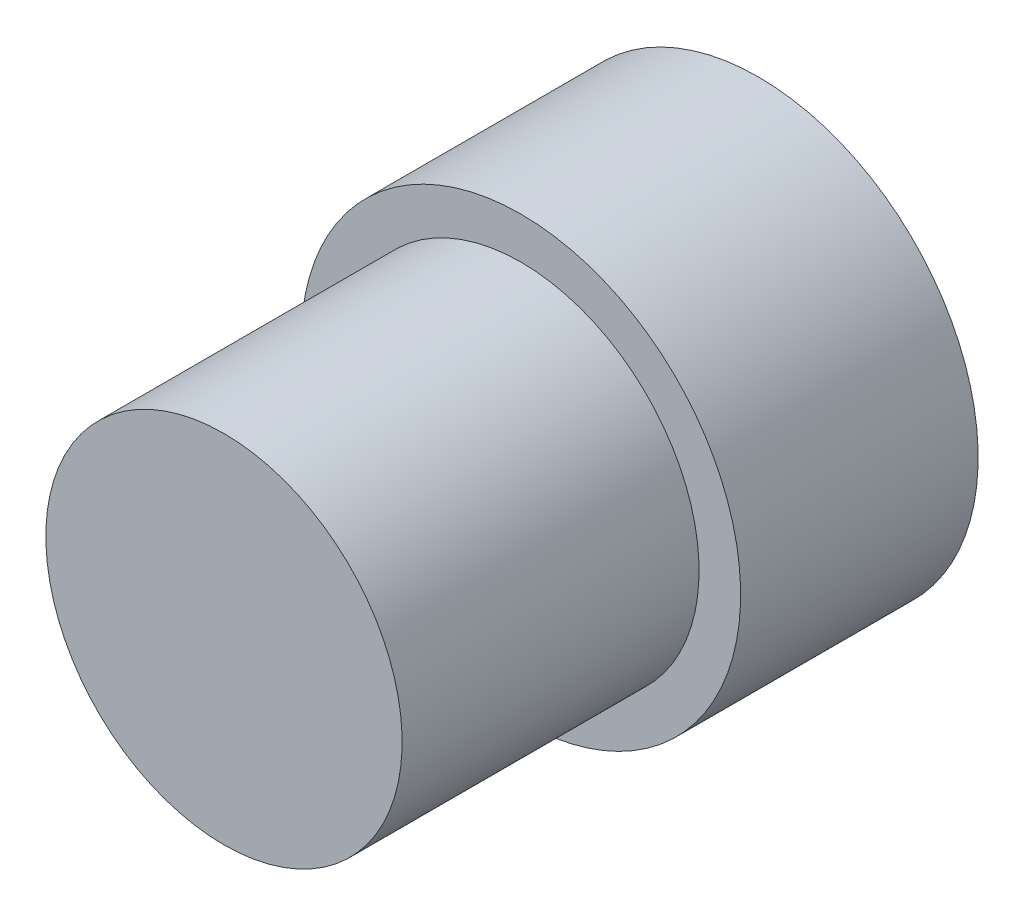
ISO-10303-21;
HEADER;
FILE_DESCRIPTION(('STEP AP214'),'2;1');
FILE_NAME('part.step','',(''),(''),'','','');
FILE_SCHEMA(('AUTOMOTIVE_DESIGN { 1 0 10303 214 1 1 1 1 }'));
ENDSEC;
DATA;
#1=APPLICATION_CONTEXT('core data for automotive mechanical design processes');
#2=APPLICATION_PROTOCOL_DEFINITION('international standard','automotive_design',2000,#1);
#3=PRODUCT_CONTEXT('',#1,'mechanical');
#4=PRODUCT('Part','Part','',(#3));
#5=PRODUCT_RELATED_PRODUCT_CATEGORY('part','',(#4));
#6=PRODUCT_DEFINITION_FORMATION('','',#4);
#7=PRODUCT_DEFINITION_CONTEXT('part definition',#1,'design');
#8=PRODUCT_DEFINITION('design','',#6,#7);
#9=PRODUCT_DEFINITION_SHAPE('','',#8);
#10=(LENGTH_UNIT() NAMED_UNIT(*) SI_UNIT(.MILLI.,.METRE.));
#11=(NAMED_UNIT(*) PLANE_ANGLE_UNIT() SI_UNIT($,.RADIAN.));
#12=(NAMED_UNIT(*) SI_UNIT($,.STERADIAN.) SOLID_ANGLE_UNIT());
#13=UNCERTAINTY_MEASURE_WITH_UNIT(LENGTH_MEASURE(1.E-05),#10,'distance_accuracy_value','');
#14=(GEOMETRIC_REPRESENTATION_CONTEXT(3) GLOBAL_UNCERTAINTY_ASSIGNED_CONTEXT((#13)) GLOBAL_UNIT_ASSIGNED_CONTEXT((#10,
#11,#12)) REPRESENTATION_CONTEXT('',''));
#15=CARTESIAN_POINT('',(0.,0.,0.));
#16=DIRECTION('',(0.,0.,1.));
#17=DIRECTION('',(1.,0.,0.));
#18=AXIS2_PLACEMENT_3D('',#15,#16,#17);
#19=CARTESIAN_POINT('',(0.,0.,0.));
#20=DIRECTION('',(0.,0.,-1.));
#21=DIRECTION('',(0.,-1.,0.));
#22=AXIS2_PLACEMENT_3D('',#19,#20,#21);
#23=CYLINDRICAL_SURFACE('',#22,8.);
#24=CARTESIAN_POINT('',(0.,0.,0.));
#25=DIRECTION('',(0.,0.,1.));
#26=DIRECTION('',(0.,-1.,0.));
#27=AXIS2_PLACEMENT_3D('',#24,#25,#26);
#28=CIRCLE('',#27,8.);
#29=CARTESIAN_POINT('',(0.,-8.,0.));
#30=VERTEX_POINT('',#29);
#31=EDGE_CURVE('E32',#30,#30,#28,.T.);
#32=ORIENTED_EDGE('',*,*,#31,.F.);
#33=EDGE_LOOP('',(#32));
#34=FACE_BOUND('',#33,.T.);
#35=CARTESIAN_POINT('',(0.,0.,20.));
#36=DIRECTION('',(0.,0.,1.));
#37=DIRECTION('',(0.,-1.,0.));
#38=AXIS2_PLACEMENT_3D('',#35,#36,#37);
#39=CIRCLE('',#38,8.);
#40=CARTESIAN_POINT('',(0.,-8.,20.));
#41=VERTEX_POINT('',#40);
#42=EDGE_CURVE('E16',#41,#41,#39,.T.);
#43=ORIENTED_EDGE('',*,*,#42,.T.);
#44=EDGE_LOOP('',(#43));
#45=FACE_BOUND('',#44,.T.);
#46=ADVANCED_FACE('F12',(#34,#45),#23,.F.);
#47=CARTESIAN_POINT('',(8.,0.,0.));
#48=DIRECTION('',(0.,0.,-1.));
#49=DIRECTION('',(0.,-1.,0.));
#50=AXIS2_PLACEMENT_3D('',#47,#48,#49);
#51=PLANE('',#50);
#52=CARTESIAN_POINT('',(1.30930626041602E-13,-12.5,0.));
#53=DIRECTION('',(0.,0.,1.));
#54=DIRECTION('',(0.,-1.,0.));
#55=AXIS2_PLACEMENT_3D('',#52,#53,#54);
#56=CIRCLE('',#55,3.);
#57=CARTESIAN_POINT('',(1.30930626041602E-13,-15.5,0.));
#58=VERTEX_POINT('',#57);
#59=EDGE_CURVE('E53',#58,#58,#56,.T.);
#60=ORIENTED_EDGE('',*,*,#59,.T.);
#61=EDGE_LOOP('',(#60));
#62=FACE_BOUND('',#61,.T.);
#63=CARTESIAN_POINT('',(-12.5,0.,0.));
#64=DIRECTION('',(0.,0.,1.));
#65=DIRECTION('',(0.,-1.,0.));
#66=AXIS2_PLACEMENT_3D('',#63,#64,#65);
#67=CIRCLE('',#66,3.);
#68=CARTESIAN_POINT('',(-12.5,-3.00000000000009,0.));
#69=VERTEX_POINT('',#68);
#70=EDGE_CURVE('E47',#69,#69,#67,.T.);
#71=ORIENTED_EDGE('',*,*,#70,.T.);
#72=EDGE_LOOP('',(#71));
#73=FACE_BOUND('',#72,.T.);
#74=CARTESIAN_POINT('',(0.,12.5,0.));
#75=DIRECTION('',(0.,0.,1.));
#76=DIRECTION('',(0.,-1.,0.));
#77=AXIS2_PLACEMENT_3D('',#74,#75,#76);
#78=CIRCLE('',#77,3.);
#79=CARTESIAN_POINT('',(0.,9.5,0.));
#80=VERTEX_POINT('',#79);
#81=EDGE_CURVE('E41',#80,#80,#78,.T.);
#82=ORIENTED_EDGE('',*,*,#81,.T.);
#83=EDGE_LOOP('',(#82));
#84=FACE_BOUND('',#83,.T.);
#85=CARTESIAN_POINT('',(12.5,0.,0.));
#86=DIRECTION('',(0.,0.,1.));
#87=DIRECTION('',(0.,-1.,0.));
#88=AXIS2_PLACEMENT_3D('',#85,#86,#87);
#89=CIRCLE('',#88,3.);
#90=CARTESIAN_POINT('',(12.5,-3.,0.));
#91=VERTEX_POINT('',#90);
#92=EDGE_CURVE('E35',#91,#91,#89,.T.);
#93=ORIENTED_EDGE('',*,*,#92,.T.);
#94=EDGE_LOOP('',(#93));
#95=FACE_BOUND('',#94,.T.);
#96=CARTESIAN_POINT('',(0.,0.,0.));
#97=DIRECTION('',(0.,0.,1.));
#98=DIRECTION('',(0.,-1.,0.));
#99=AXIS2_PLACEMENT_3D('',#96,#97,#98);
#100=CIRCLE('',#99,18.5);
#101=CARTESIAN_POINT('',(0.,-18.5,0.));
#102=VERTEX_POINT('',#101);
#103=EDGE_CURVE('E8',#102,#102,#100,.T.);
#104=ORIENTED_EDGE('',*,*,#103,.F.);
#105=EDGE_LOOP('',(#104));
#106=FACE_BOUND('',#105,.T.);
#107=ORIENTED_EDGE('',*,*,#31,.T.);
#108=EDGE_LOOP('',(#107));
#109=FACE_BOUND('',#108,.T.);
#110=ADVANCED_FACE('F14',(#62,#73,#84,#95,#106,#109),#51,.T.);
#111=CARTESIAN_POINT('',(0.,0.,0.));
#112=DIRECTION('',(0.,0.,-1.));
#113=DIRECTION('',(0.,-1.,0.));
#114=AXIS2_PLACEMENT_3D('',#111,#112,#113);
#115=CYLINDRICAL_SURFACE('',#114,18.5);
#116=CARTESIAN_POINT('',(0.,0.,20.));
#117=DIRECTION('',(0.,0.,1.));
#118=DIRECTION('',(0.,-1.,0.));
#119=AXIS2_PLACEMENT_3D('',#116,#117,#118);
#120=CIRCLE('',#119,18.5);
#121=CARTESIAN_POINT('',(0.,-18.5,20.));
#122=VERTEX_POINT('',#121);
#123=EDGE_CURVE('E20',#122,#122,#120,.T.);
#124=ORIENTED_EDGE('',*,*,#123,.F.);
#125=EDGE_LOOP('',(#124));
#126=FACE_BOUND('',#125,.T.);
#127=ORIENTED_EDGE('',*,*,#103,.T.);
#128=EDGE_LOOP('',(#127));
#129=FACE_BOUND('',#128,.T.);
#130=ADVANCED_FACE('F83',(#126,#129),#115,.T.);
#131=CARTESIAN_POINT('',(15.,0.,20.));
#132=DIRECTION('',(0.,0.,1.));
#133=DIRECTION('',(0.,1.,0.));
#134=AXIS2_PLACEMENT_3D('',#131,#132,#133);
#135=PLANE('',#134);
#136=CARTESIAN_POINT('',(0.,0.,20.));
#137=DIRECTION('',(0.,0.,1.));
#138=DIRECTION('',(0.,-1.,0.));
#139=AXIS2_PLACEMENT_3D('',#136,#137,#138);
#140=CIRCLE('',#139,15.);
#141=CARTESIAN_POINT('',(0.,-15.,20.));
#142=VERTEX_POINT('',#141);
#143=EDGE_CURVE('E24',#142,#142,#140,.T.);
#144=ORIENTED_EDGE('',*,*,#143,.F.);
#145=EDGE_LOOP('',(#144));
#146=FACE_BOUND('',#145,.T.);
#147=ORIENTED_EDGE('',*,*,#123,.T.);
#148=EDGE_LOOP('',(#147));
#149=FACE_BOUND('',#148,.T.);
#150=ADVANCED_FACE('F97',(#146,#149),#135,.T.);
#151=CARTESIAN_POINT('',(0.,0.,0.));
#152=DIRECTION('',(0.,0.,-1.));
#153=DIRECTION('',(0.,-1.,0.));
#154=AXIS2_PLACEMENT_3D('',#151,#152,#153);
#155=CYLINDRICAL_SURFACE('',#154,15.);
#156=CARTESIAN_POINT('',(0.,0.,45.));
#157=DIRECTION('',(0.,0.,1.));
#158=DIRECTION('',(0.,-1.,0.));
#159=AXIS2_PLACEMENT_3D('',#156,#157,#158);
#160=CIRCLE('',#159,15.);
#161=CARTESIAN_POINT('',(0.,-15.,45.));
#162=VERTEX_POINT('',#161);
#163=EDGE_CURVE('E29',#162,#162,#160,.T.);
#164=ORIENTED_EDGE('',*,*,#163,.F.);
#165=EDGE_LOOP('',(#164));
#166=FACE_BOUND('',#165,.T.);
#167=ORIENTED_EDGE('',*,*,#143,.T.);
#168=EDGE_LOOP('',(#167));
#169=FACE_BOUND('',#168,.T.);
#170=ADVANCED_FACE('F93',(#166,#169),#155,.T.);
#171=CARTESIAN_POINT('',(8.,0.,45.));
#172=DIRECTION('',(0.,0.,1.));
#173=DIRECTION('',(0.,1.,0.));
#174=AXIS2_PLACEMENT_3D('',#171,#172,#173);
#175=PLANE('',#174);
#176=ORIENTED_EDGE('',*,*,#163,.T.);
#177=EDGE_LOOP('',(#176));
#178=FACE_BOUND('',#177,.T.);
#179=ADVANCED_FACE('F90',(#178),#175,.T.);
#180=CARTESIAN_POINT('',(12.5,0.,0.));
#181=DIRECTION('',(0.,0.,-1.));
#182=DIRECTION('',(0.,-1.,0.));
#183=AXIS2_PLACEMENT_3D('',#180,#181,#182);
#184=CYLINDRICAL_SURFACE('',#183,3.);
#185=CARTESIAN_POINT('',(12.5,0.,12.));
#186=DIRECTION('',(0.,0.,1.));
#187=DIRECTION('',(0.,-1.,0.));
#188=AXIS2_PLACEMENT_3D('',#185,#186,#187);
#189=CIRCLE('',#188,3.);
#190=CARTESIAN_POINT('',(12.5,-3.,12.));
#191=VERTEX_POINT('',#190);
#192=EDGE_CURVE('E38',#191,#191,#189,.T.);
#193=ORIENTED_EDGE('',*,*,#192,.T.);
#194=EDGE_LOOP('',(#193));
#195=FACE_BOUND('',#194,.T.);
#196=ORIENTED_EDGE('',*,*,#92,.F.);
#197=EDGE_LOOP('',(#196));
#198=FACE_BOUND('',#197,.T.);
#199=ADVANCED_FACE('F88',(#195,#198),#184,.F.);
#200=CARTESIAN_POINT('',(15.,0.,12.));
#201=DIRECTION('',(0.,0.,1.));
#202=DIRECTION('',(0.,1.,0.));
#203=AXIS2_PLACEMENT_3D('',#200,#201,#202);
#204=PLANE('',#203);
#205=ORIENTED_EDGE('',*,*,#192,.F.);
#206=EDGE_LOOP('',(#205));
#207=FACE_BOUND('',#206,.T.);
#208=ADVANCED_FACE('F136',(#207),#204,.F.);
#209=CARTESIAN_POINT('',(0.,12.5,0.));
#210=DIRECTION('',(0.,0.,-1.));
#211=DIRECTION('',(0.,-1.,0.));
#212=AXIS2_PLACEMENT_3D('',#209,#210,#211);
#213=CYLINDRICAL_SURFACE('',#212,3.);
#214=CARTESIAN_POINT('',(0.,12.5,12.));
#215=DIRECTION('',(0.,0.,1.));
#216=DIRECTION('',(0.,-1.,0.));
#217=AXIS2_PLACEMENT_3D('',#214,#215,#216);
#218=CIRCLE('',#217,3.);
#219=CARTESIAN_POINT('',(0.,9.5,12.));
#220=VERTEX_POINT('',#219);
#221=EDGE_CURVE('E44',#220,#220,#218,.T.);
#222=ORIENTED_EDGE('',*,*,#221,.T.);
#223=EDGE_LOOP('',(#222));
#224=FACE_BOUND('',#223,.T.);
#225=ORIENTED_EDGE('',*,*,#81,.F.);
#226=EDGE_LOOP('',(#225));
#227=FACE_BOUND('',#226,.T.);
#228=ADVANCED_FACE('F144',(#224,#227),#213,.F.);
#229=CARTESIAN_POINT('',(2.49999999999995,12.5,12.));
#230=DIRECTION('',(0.,0.,1.));
#231=DIRECTION('',(0.,1.,0.));
#232=AXIS2_PLACEMENT_3D('',#229,#230,#231);
#233=PLANE('',#232);
#234=ORIENTED_EDGE('',*,*,#221,.F.);
#235=EDGE_LOOP('',(#234));
#236=FACE_BOUND('',#235,.T.);
#237=ADVANCED_FACE('F152',(#236),#233,.F.);
#238=CARTESIAN_POINT('',(-12.5,0.,0.));
#239=DIRECTION('',(0.,0.,-1.));
#240=DIRECTION('',(0.,-1.,0.));
#241=AXIS2_PLACEMENT_3D('',#238,#239,#240);
#242=CYLINDRICAL_SURFACE('',#241,3.);
#243=CARTESIAN_POINT('',(-12.5,0.,12.));
#244=DIRECTION('',(0.,0.,1.));
#245=DIRECTION('',(0.,-1.,0.));
#246=AXIS2_PLACEMENT_3D('',#243,#244,#245);
#247=CIRCLE('',#246,3.);
#248=CARTESIAN_POINT('',(-12.5,-3.00000000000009,12.));
#249=VERTEX_POINT('',#248);
#250=EDGE_CURVE('E50',#249,#249,#247,.T.);
#251=ORIENTED_EDGE('',*,*,#250,.T.);
#252=EDGE_LOOP('',(#251));
#253=FACE_BOUND('',#252,.T.);
#254=ORIENTED_EDGE('',*,*,#70,.F.);
#255=EDGE_LOOP('',(#254));
#256=FACE_BOUND('',#255,.T.);
#257=ADVANCED_FACE('F161',(#253,#256),#242,.F.);
#258=CARTESIAN_POINT('',(-10.,0.,12.));
#259=DIRECTION('',(0.,0.,1.));
#260=DIRECTION('',(0.,1.,0.));
#261=AXIS2_PLACEMENT_3D('',#258,#259,#260);
#262=PLANE('',#261);
#263=ORIENTED_EDGE('',*,*,#250,.F.);
#264=EDGE_LOOP('',(#263));
#265=FACE_BOUND('',#264,.T.);
#266=ADVANCED_FACE('F170',(#265),#262,.F.);
#267=CARTESIAN_POINT('',(1.30930626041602E-13,-12.5,0.));
#268=DIRECTION('',(0.,0.,-1.));
#269=DIRECTION('',(0.,-1.,0.));
#270=AXIS2_PLACEMENT_3D('',#267,#268,#269);
#271=CYLINDRICAL_SURFACE('',#270,3.);
#272=CARTESIAN_POINT('',(1.30930626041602E-13,-12.5,12.));
#273=DIRECTION('',(0.,0.,1.));
#274=DIRECTION('',(0.,-1.,0.));
#275=AXIS2_PLACEMENT_3D('',#272,#273,#274);
#276=CIRCLE('',#275,3.);
#277=CARTESIAN_POINT('',(1.30930626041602E-13,-15.5,12.));
#278=VERTEX_POINT('',#277);
#279=EDGE_CURVE('E56',#278,#278,#276,.T.);
#280=ORIENTED_EDGE('',*,*,#279,.T.);
#281=EDGE_LOOP('',(#280));
#282=FACE_BOUND('',#281,.T.);
#283=ORIENTED_EDGE('',*,*,#59,.F.);
#284=EDGE_LOOP('',(#283));
#285=FACE_BOUND('',#284,.T.);
#286=ADVANCED_FACE('F73',(#282,#285),#271,.F.);
#287=CARTESIAN_POINT('',(2.50000000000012,-12.5,12.));
#288=DIRECTION('',(0.,0.,1.));
#289=DIRECTION('',(0.,1.,0.));
#290=AXIS2_PLACEMENT_3D('',#287,#288,#289);
#291=PLANE('',#290);
#292=ORIENTED_EDGE('',*,*,#279,.F.);
#293=EDGE_LOOP('',(#292));
#294=FACE_BOUND('',#293,.T.);
#295=ADVANCED_FACE('F66',(#294),#291,.F.);
#296=CARTESIAN_POINT('',(0.,0.,20.));
#297=DIRECTION('',(0.,0.,1.));
#298=DIRECTION('',(0.,-1.,0.));
#299=AXIS2_PLACEMENT_3D('',#296,#297,#298);
#300=PLANE('',#299);
#301=ORIENTED_EDGE('',*,*,#42,.F.);
#302=EDGE_LOOP('',(#301));
#303=FACE_BOUND('',#302,.T.);
#304=ADVANCED_FACE('F64',(#303),#300,.F.);
#305=CLOSED_SHELL('',(#46,#110,#130,#150,#170,#179,#199,#208,#228,#237,#257,#266,#286,#295,#304));
#306=MANIFOLD_SOLID_BREP('B1',#305);
#307=ADVANCED_BREP_SHAPE_REPRESENTATION('',(#18,#306),#14);
#308=SHAPE_DEFINITION_REPRESENTATION(#9,#307);
ENDSEC;
END-ISO-10303-21;
